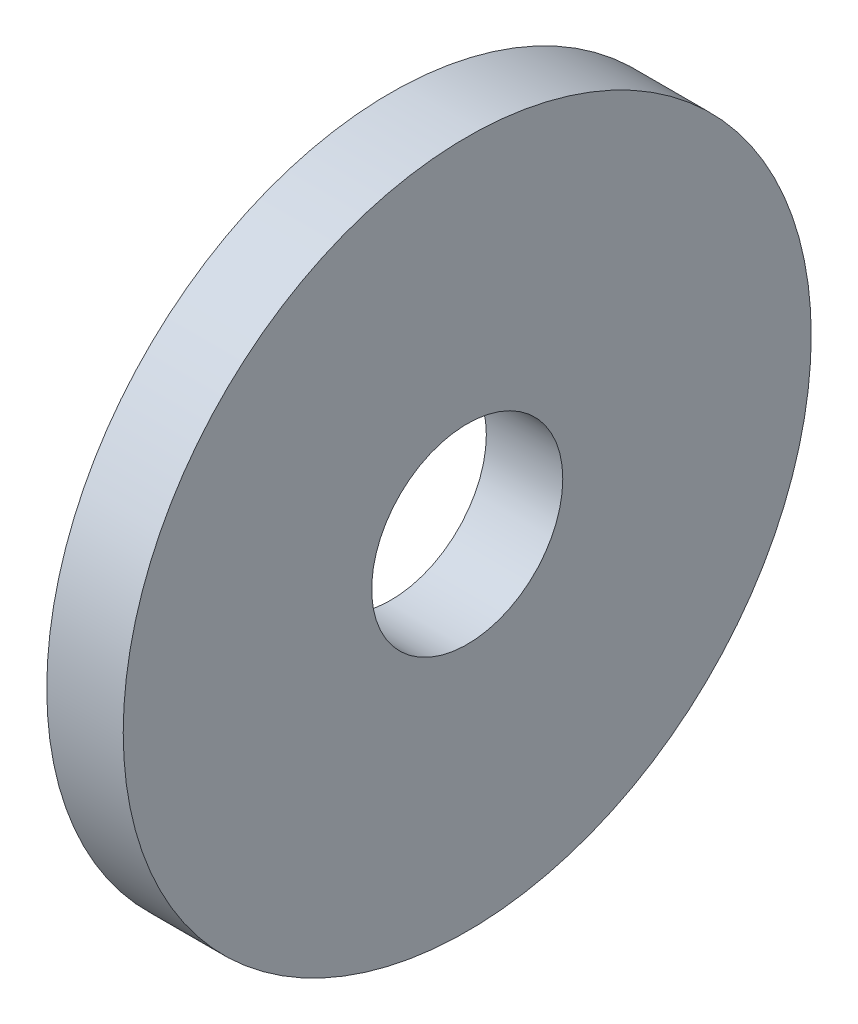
from build123d import *

# Parameters (mm, degrees)
SKETCH1_R          = 4.5
SKETCH1_R_2        = 1.25
BASE_EXTRUDE_DEPTH = 1


with BuildPart() as part:
    # Sketch1 → Base-Extrude (new body)
    with BuildSketch(Plane(origin=(0, 0, 0), x_dir=(0, 0, -1), z_dir=(1, 0, 0))):
        Circle(SKETCH1_R)
        Circle(SKETCH1_R_2, mode=Mode.SUBTRACT)
    extrude(amount=BASE_EXTRUDE_DEPTH)


solid = part.part
